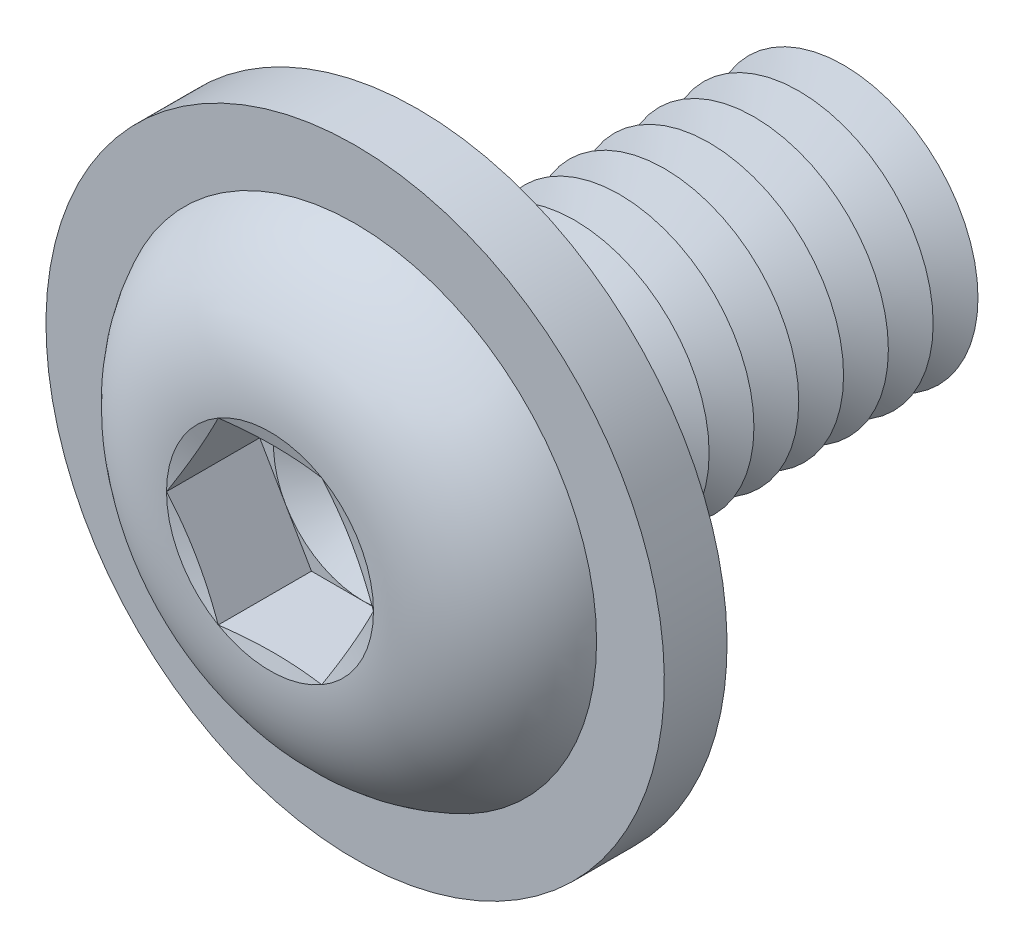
ISO-10303-21;
HEADER;
FILE_DESCRIPTION(('STEP AP214'),'2;1');
FILE_NAME('part.step','',(''),(''),'','','');
FILE_SCHEMA(('AUTOMOTIVE_DESIGN { 1 0 10303 214 1 1 1 1 }'));
ENDSEC;
DATA;
#1=APPLICATION_CONTEXT('core data for automotive mechanical design processes');
#2=APPLICATION_PROTOCOL_DEFINITION('international standard','automotive_design',2000,#1);
#3=PRODUCT_CONTEXT('',#1,'mechanical');
#4=PRODUCT('Part','Part','',(#3));
#5=PRODUCT_RELATED_PRODUCT_CATEGORY('part','',(#4));
#6=PRODUCT_DEFINITION_FORMATION('','',#4);
#7=PRODUCT_DEFINITION_CONTEXT('part definition',#1,'design');
#8=PRODUCT_DEFINITION('design','',#6,#7);
#9=PRODUCT_DEFINITION_SHAPE('','',#8);
#10=(LENGTH_UNIT() NAMED_UNIT(*) SI_UNIT(.MILLI.,.METRE.));
#11=(NAMED_UNIT(*) PLANE_ANGLE_UNIT() SI_UNIT($,.RADIAN.));
#12=(NAMED_UNIT(*) SI_UNIT($,.STERADIAN.) SOLID_ANGLE_UNIT());
#13=UNCERTAINTY_MEASURE_WITH_UNIT(LENGTH_MEASURE(1.E-05),#10,'distance_accuracy_value','');
#14=(GEOMETRIC_REPRESENTATION_CONTEXT(3) GLOBAL_UNCERTAINTY_ASSIGNED_CONTEXT((#13)) GLOBAL_UNIT_ASSIGNED_CONTEXT((#10,
#11,#12)) REPRESENTATION_CONTEXT('',''));
#15=CARTESIAN_POINT('',(0.,0.,0.));
#16=DIRECTION('',(0.,0.,1.));
#17=DIRECTION('',(1.,0.,0.));
#18=AXIS2_PLACEMENT_3D('',#15,#16,#17);
#19=CARTESIAN_POINT('',(0.,0.,-3.25));
#20=DIRECTION('',(0.,0.,1.));
#21=DIRECTION('',(1.,0.,0.));
#22=AXIS2_PLACEMENT_3D('',#19,#20,#21);
#23=CONICAL_SURFACE('',#22,1.5,1.0471975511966);
#24=CARTESIAN_POINT('',(0.,0.,-3.5));
#25=DIRECTION('',(0.,0.,1.));
#26=DIRECTION('',(1.,0.,0.));
#27=AXIS2_PLACEMENT_3D('',#24,#25,#26);
#28=CIRCLE('',#27,1.06698729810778);
#29=CARTESIAN_POINT('',(1.06698729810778,0.,-3.5));
#30=VERTEX_POINT('',#29);
#31=EDGE_CURVE('E290',#30,#30,#28,.T.);
#32=ORIENTED_EDGE('',*,*,#31,.T.);
#33=EDGE_LOOP('',(#32));
#34=FACE_BOUND('',#33,.T.);
#35=CARTESIAN_POINT('',(0.,0.,-3.25));
#36=DIRECTION('',(0.,0.,1.));
#37=DIRECTION('',(1.,0.,0.));
#38=AXIS2_PLACEMENT_3D('',#35,#36,#37);
#39=CIRCLE('',#38,1.5);
#40=CARTESIAN_POINT('',(1.5,0.,-3.25));
#41=VERTEX_POINT('',#40);
#42=EDGE_CURVE('E286',#41,#41,#39,.T.);
#43=ORIENTED_EDGE('',*,*,#42,.F.);
#44=EDGE_LOOP('',(#43));
#45=FACE_BOUND('',#44,.T.);
#46=ADVANCED_FACE('F39',(#34,#45),#23,.T.);
#47=CARTESIAN_POINT('',(0.,0.,-3.5));
#48=DIRECTION('',(0.,0.,-1.));
#49=DIRECTION('',(-1.,0.,0.));
#50=AXIS2_PLACEMENT_3D('',#47,#48,#49);
#51=CONICAL_SURFACE('',#50,1.06698729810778,1.0471975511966);
#52=CARTESIAN_POINT('',(0.,0.,-3.75));
#53=DIRECTION('',(0.,0.,1.));
#54=DIRECTION('',(1.,0.,0.));
#55=AXIS2_PLACEMENT_3D('',#52,#53,#54);
#56=CIRCLE('',#55,1.5);
#57=CARTESIAN_POINT('',(1.5,0.,-3.75));
#58=VERTEX_POINT('',#57);
#59=EDGE_CURVE('E294',#58,#58,#56,.T.);
#60=ORIENTED_EDGE('',*,*,#59,.T.);
#61=EDGE_LOOP('',(#60));
#62=FACE_BOUND('',#61,.T.);
#63=ORIENTED_EDGE('',*,*,#31,.F.);
#64=EDGE_LOOP('',(#63));
#65=FACE_BOUND('',#64,.T.);
#66=ADVANCED_FACE('F405',(#62,#65),#51,.T.);
#67=CARTESIAN_POINT('',(0.,1.5,-5.));
#68=DIRECTION('',(0.,0.,-1.));
#69=DIRECTION('',(-1.,0.,0.));
#70=AXIS2_PLACEMENT_3D('',#67,#68,#69);
#71=PLANE('',#70);
#72=CARTESIAN_POINT('',(0.,0.,-5.));
#73=DIRECTION('',(0.,0.,1.));
#74=DIRECTION('',(1.,0.,0.));
#75=AXIS2_PLACEMENT_3D('',#72,#73,#74);
#76=CIRCLE('',#75,1.06698729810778);
#77=CARTESIAN_POINT('',(1.06698729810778,0.,-5.));
#78=VERTEX_POINT('',#77);
#79=EDGE_CURVE('E314',#78,#78,#76,.T.);
#80=ORIENTED_EDGE('',*,*,#79,.F.);
#81=EDGE_LOOP('',(#80));
#82=FACE_BOUND('',#81,.T.);
#83=ADVANCED_FACE('F411',(#82),#71,.T.);
#84=CARTESIAN_POINT('',(0.,0.,-4.75));
#85=DIRECTION('',(0.,0.,1.));
#86=DIRECTION('',(1.,0.,0.));
#87=AXIS2_PLACEMENT_3D('',#84,#85,#86);
#88=CONICAL_SURFACE('',#87,1.5,1.0471975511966);
#89=ORIENTED_EDGE('',*,*,#79,.T.);
#90=EDGE_LOOP('',(#89));
#91=FACE_BOUND('',#90,.T.);
#92=CARTESIAN_POINT('',(0.,0.,-4.75));
#93=DIRECTION('',(0.,0.,1.));
#94=DIRECTION('',(1.,0.,0.));
#95=AXIS2_PLACEMENT_3D('',#92,#93,#94);
#96=CIRCLE('',#95,1.5);
#97=CARTESIAN_POINT('',(1.5,0.,-4.75));
#98=VERTEX_POINT('',#97);
#99=EDGE_CURVE('E310',#98,#98,#96,.T.);
#100=ORIENTED_EDGE('',*,*,#99,.F.);
#101=EDGE_LOOP('',(#100));
#102=FACE_BOUND('',#101,.T.);
#103=ADVANCED_FACE('F430',(#91,#102),#88,.T.);
#104=CARTESIAN_POINT('',(0.,0.,-4.5));
#105=DIRECTION('',(0.,0.,-1.));
#106=DIRECTION('',(-1.,0.,0.));
#107=AXIS2_PLACEMENT_3D('',#104,#105,#106);
#108=CONICAL_SURFACE('',#107,1.06698729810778,1.0471975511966);
#109=ORIENTED_EDGE('',*,*,#99,.T.);
#110=EDGE_LOOP('',(#109));
#111=FACE_BOUND('',#110,.T.);
#112=CARTESIAN_POINT('',(0.,0.,-4.5));
#113=DIRECTION('',(0.,0.,1.));
#114=DIRECTION('',(1.,0.,0.));
#115=AXIS2_PLACEMENT_3D('',#112,#113,#114);
#116=CIRCLE('',#115,1.06698729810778);
#117=CARTESIAN_POINT('',(1.06698729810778,0.,-4.5));
#118=VERTEX_POINT('',#117);
#119=EDGE_CURVE('E306',#118,#118,#116,.T.);
#120=ORIENTED_EDGE('',*,*,#119,.F.);
#121=EDGE_LOOP('',(#120));
#122=FACE_BOUND('',#121,.T.);
#123=ADVANCED_FACE('F427',(#111,#122),#108,.T.);
#124=CARTESIAN_POINT('',(0.,0.,-4.25));
#125=DIRECTION('',(0.,0.,1.));
#126=DIRECTION('',(1.,0.,0.));
#127=AXIS2_PLACEMENT_3D('',#124,#125,#126);
#128=CONICAL_SURFACE('',#127,1.5,1.0471975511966);
#129=ORIENTED_EDGE('',*,*,#119,.T.);
#130=EDGE_LOOP('',(#129));
#131=FACE_BOUND('',#130,.T.);
#132=CARTESIAN_POINT('',(0.,0.,-4.25));
#133=DIRECTION('',(0.,0.,1.));
#134=DIRECTION('',(1.,0.,0.));
#135=AXIS2_PLACEMENT_3D('',#132,#133,#134);
#136=CIRCLE('',#135,1.5);
#137=CARTESIAN_POINT('',(1.5,0.,-4.25));
#138=VERTEX_POINT('',#137);
#139=EDGE_CURVE('E302',#138,#138,#136,.T.);
#140=ORIENTED_EDGE('',*,*,#139,.F.);
#141=EDGE_LOOP('',(#140));
#142=FACE_BOUND('',#141,.T.);
#143=ADVANCED_FACE('F421',(#131,#142),#128,.T.);
#144=CARTESIAN_POINT('',(0.,0.,-4.));
#145=DIRECTION('',(0.,0.,-1.));
#146=DIRECTION('',(-1.,0.,0.));
#147=AXIS2_PLACEMENT_3D('',#144,#145,#146);
#148=CONICAL_SURFACE('',#147,1.06698729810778,1.0471975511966);
#149=ORIENTED_EDGE('',*,*,#139,.T.);
#150=EDGE_LOOP('',(#149));
#151=FACE_BOUND('',#150,.T.);
#152=CARTESIAN_POINT('',(0.,0.,-4.));
#153=DIRECTION('',(0.,0.,1.));
#154=DIRECTION('',(1.,0.,0.));
#155=AXIS2_PLACEMENT_3D('',#152,#153,#154);
#156=CIRCLE('',#155,1.06698729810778);
#157=CARTESIAN_POINT('',(1.06698729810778,0.,-4.));
#158=VERTEX_POINT('',#157);
#159=EDGE_CURVE('E298',#158,#158,#156,.T.);
#160=ORIENTED_EDGE('',*,*,#159,.F.);
#161=EDGE_LOOP('',(#160));
#162=FACE_BOUND('',#161,.T.);
#163=ADVANCED_FACE('F417',(#151,#162),#148,.T.);
#164=CARTESIAN_POINT('',(0.,0.,-3.75));
#165=DIRECTION('',(0.,0.,1.));
#166=DIRECTION('',(1.,0.,0.));
#167=AXIS2_PLACEMENT_3D('',#164,#165,#166);
#168=CONICAL_SURFACE('',#167,1.5,1.0471975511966);
#169=ORIENTED_EDGE('',*,*,#159,.T.);
#170=EDGE_LOOP('',(#169));
#171=FACE_BOUND('',#170,.T.);
#172=ORIENTED_EDGE('',*,*,#59,.F.);
#173=EDGE_LOOP('',(#172));
#174=FACE_BOUND('',#173,.T.);
#175=ADVANCED_FACE('F420',(#171,#174),#168,.T.);
#176=CARTESIAN_POINT('',(0.,0.,-2.75));
#177=DIRECTION('',(0.,0.,1.));
#178=DIRECTION('',(1.,0.,0.));
#179=AXIS2_PLACEMENT_3D('',#176,#177,#178);
#180=CONICAL_SURFACE('',#179,1.5,1.0471975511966);
#181=CARTESIAN_POINT('',(0.,0.,-3.));
#182=DIRECTION('',(0.,0.,1.));
#183=DIRECTION('',(1.,0.,0.));
#184=AXIS2_PLACEMENT_3D('',#181,#182,#183);
#185=CIRCLE('',#184,1.06698729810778);
#186=CARTESIAN_POINT('',(1.06698729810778,0.,-3.));
#187=VERTEX_POINT('',#186);
#188=EDGE_CURVE('E282',#187,#187,#185,.T.);
#189=ORIENTED_EDGE('',*,*,#188,.T.);
#190=EDGE_LOOP('',(#189));
#191=FACE_BOUND('',#190,.T.);
#192=CARTESIAN_POINT('',(0.,0.,-2.75));
#193=DIRECTION('',(0.,0.,1.));
#194=DIRECTION('',(1.,0.,0.));
#195=AXIS2_PLACEMENT_3D('',#192,#193,#194);
#196=CIRCLE('',#195,1.5);
#197=CARTESIAN_POINT('',(1.5,0.,-2.75));
#198=VERTEX_POINT('',#197);
#199=EDGE_CURVE('E278',#198,#198,#196,.T.);
#200=ORIENTED_EDGE('',*,*,#199,.F.);
#201=EDGE_LOOP('',(#200));
#202=FACE_BOUND('',#201,.T.);
#203=ADVANCED_FACE('F425',(#191,#202),#180,.T.);
#204=CARTESIAN_POINT('',(0.,0.,-3.));
#205=DIRECTION('',(0.,0.,-1.));
#206=DIRECTION('',(-1.,0.,0.));
#207=AXIS2_PLACEMENT_3D('',#204,#205,#206);
#208=CONICAL_SURFACE('',#207,1.06698729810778,1.0471975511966);
#209=ORIENTED_EDGE('',*,*,#42,.T.);
#210=EDGE_LOOP('',(#209));
#211=FACE_BOUND('',#210,.T.);
#212=ORIENTED_EDGE('',*,*,#188,.F.);
#213=EDGE_LOOP('',(#212));
#214=FACE_BOUND('',#213,.T.);
#215=ADVANCED_FACE('F476',(#211,#214),#208,.T.);
#216=CARTESIAN_POINT('',(0.,0.,-2.25));
#217=DIRECTION('',(0.,0.,1.));
#218=DIRECTION('',(1.,0.,0.));
#219=AXIS2_PLACEMENT_3D('',#216,#217,#218);
#220=CONICAL_SURFACE('',#219,1.5,1.0471975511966);
#221=CARTESIAN_POINT('',(0.,0.,-2.5));
#222=DIRECTION('',(0.,0.,1.));
#223=DIRECTION('',(1.,0.,0.));
#224=AXIS2_PLACEMENT_3D('',#221,#222,#223);
#225=CIRCLE('',#224,1.06698729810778);
#226=CARTESIAN_POINT('',(1.06698729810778,0.,-2.5));
#227=VERTEX_POINT('',#226);
#228=EDGE_CURVE('E274',#227,#227,#225,.T.);
#229=ORIENTED_EDGE('',*,*,#228,.T.);
#230=EDGE_LOOP('',(#229));
#231=FACE_BOUND('',#230,.T.);
#232=CARTESIAN_POINT('',(0.,0.,-2.25));
#233=DIRECTION('',(0.,0.,1.));
#234=DIRECTION('',(1.,0.,0.));
#235=AXIS2_PLACEMENT_3D('',#232,#233,#234);
#236=CIRCLE('',#235,1.5);
#237=CARTESIAN_POINT('',(1.5,0.,-2.25));
#238=VERTEX_POINT('',#237);
#239=EDGE_CURVE('E270',#238,#238,#236,.T.);
#240=ORIENTED_EDGE('',*,*,#239,.F.);
#241=EDGE_LOOP('',(#240));
#242=FACE_BOUND('',#241,.T.);
#243=ADVANCED_FACE('F482',(#231,#242),#220,.T.);
#244=CARTESIAN_POINT('',(0.,0.,-2.5));
#245=DIRECTION('',(0.,0.,-1.));
#246=DIRECTION('',(-1.,0.,0.));
#247=AXIS2_PLACEMENT_3D('',#244,#245,#246);
#248=CONICAL_SURFACE('',#247,1.06698729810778,1.0471975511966);
#249=ORIENTED_EDGE('',*,*,#199,.T.);
#250=EDGE_LOOP('',(#249));
#251=FACE_BOUND('',#250,.T.);
#252=ORIENTED_EDGE('',*,*,#228,.F.);
#253=EDGE_LOOP('',(#252));
#254=FACE_BOUND('',#253,.T.);
#255=ADVANCED_FACE('F489',(#251,#254),#248,.T.);
#256=CARTESIAN_POINT('',(0.,0.,-1.75));
#257=DIRECTION('',(0.,0.,1.));
#258=DIRECTION('',(1.,0.,0.));
#259=AXIS2_PLACEMENT_3D('',#256,#257,#258);
#260=CONICAL_SURFACE('',#259,1.5,1.0471975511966);
#261=CARTESIAN_POINT('',(0.,0.,-2.));
#262=DIRECTION('',(0.,0.,1.));
#263=DIRECTION('',(1.,0.,0.));
#264=AXIS2_PLACEMENT_3D('',#261,#262,#263);
#265=CIRCLE('',#264,1.06698729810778);
#266=CARTESIAN_POINT('',(1.06698729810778,0.,-2.));
#267=VERTEX_POINT('',#266);
#268=EDGE_CURVE('E266',#267,#267,#265,.T.);
#269=ORIENTED_EDGE('',*,*,#268,.T.);
#270=EDGE_LOOP('',(#269));
#271=FACE_BOUND('',#270,.T.);
#272=CARTESIAN_POINT('',(0.,0.,-1.75));
#273=DIRECTION('',(0.,0.,1.));
#274=DIRECTION('',(1.,0.,0.));
#275=AXIS2_PLACEMENT_3D('',#272,#273,#274);
#276=CIRCLE('',#275,1.5);
#277=CARTESIAN_POINT('',(1.5,0.,-1.75));
#278=VERTEX_POINT('',#277);
#279=EDGE_CURVE('E262',#278,#278,#276,.T.);
#280=ORIENTED_EDGE('',*,*,#279,.F.);
#281=EDGE_LOOP('',(#280));
#282=FACE_BOUND('',#281,.T.);
#283=ADVANCED_FACE('F496',(#271,#282),#260,.T.);
#284=CARTESIAN_POINT('',(0.,0.,-2.));
#285=DIRECTION('',(0.,0.,-1.));
#286=DIRECTION('',(-1.,0.,0.));
#287=AXIS2_PLACEMENT_3D('',#284,#285,#286);
#288=CONICAL_SURFACE('',#287,1.06698729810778,1.0471975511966);
#289=ORIENTED_EDGE('',*,*,#239,.T.);
#290=EDGE_LOOP('',(#289));
#291=FACE_BOUND('',#290,.T.);
#292=ORIENTED_EDGE('',*,*,#268,.F.);
#293=EDGE_LOOP('',(#292));
#294=FACE_BOUND('',#293,.T.);
#295=ADVANCED_FACE('F503',(#291,#294),#288,.T.);
#296=CARTESIAN_POINT('',(0.,0.,-1.25));
#297=DIRECTION('',(0.,0.,1.));
#298=DIRECTION('',(1.,0.,0.));
#299=AXIS2_PLACEMENT_3D('',#296,#297,#298);
#300=CONICAL_SURFACE('',#299,1.5,1.0471975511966);
#301=CARTESIAN_POINT('',(0.,0.,-1.5));
#302=DIRECTION('',(0.,0.,1.));
#303=DIRECTION('',(1.,0.,0.));
#304=AXIS2_PLACEMENT_3D('',#301,#302,#303);
#305=CIRCLE('',#304,1.06698729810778);
#306=CARTESIAN_POINT('',(1.06698729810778,0.,-1.5));
#307=VERTEX_POINT('',#306);
#308=EDGE_CURVE('E258',#307,#307,#305,.T.);
#309=ORIENTED_EDGE('',*,*,#308,.T.);
#310=EDGE_LOOP('',(#309));
#311=FACE_BOUND('',#310,.T.);
#312=CARTESIAN_POINT('',(0.,0.,-1.25));
#313=DIRECTION('',(0.,0.,1.));
#314=DIRECTION('',(1.,0.,0.));
#315=AXIS2_PLACEMENT_3D('',#312,#313,#314);
#316=CIRCLE('',#315,1.5);
#317=CARTESIAN_POINT('',(1.5,0.,-1.25));
#318=VERTEX_POINT('',#317);
#319=EDGE_CURVE('E254',#318,#318,#316,.T.);
#320=ORIENTED_EDGE('',*,*,#319,.F.);
#321=EDGE_LOOP('',(#320));
#322=FACE_BOUND('',#321,.T.);
#323=ADVANCED_FACE('F510',(#311,#322),#300,.T.);
#324=CARTESIAN_POINT('',(0.,0.,-1.5));
#325=DIRECTION('',(0.,0.,-1.));
#326=DIRECTION('',(-1.,0.,0.));
#327=AXIS2_PLACEMENT_3D('',#324,#325,#326);
#328=CONICAL_SURFACE('',#327,1.06698729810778,1.0471975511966);
#329=ORIENTED_EDGE('',*,*,#279,.T.);
#330=EDGE_LOOP('',(#329));
#331=FACE_BOUND('',#330,.T.);
#332=ORIENTED_EDGE('',*,*,#308,.F.);
#333=EDGE_LOOP('',(#332));
#334=FACE_BOUND('',#333,.T.);
#335=ADVANCED_FACE('F517',(#331,#334),#328,.T.);
#336=CARTESIAN_POINT('',(0.,0.,-0.75));
#337=DIRECTION('',(0.,0.,1.));
#338=DIRECTION('',(1.,0.,0.));
#339=AXIS2_PLACEMENT_3D('',#336,#337,#338);
#340=CONICAL_SURFACE('',#339,1.5,1.0471975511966);
#341=CARTESIAN_POINT('',(0.,0.,-1.));
#342=DIRECTION('',(0.,0.,1.));
#343=DIRECTION('',(1.,0.,0.));
#344=AXIS2_PLACEMENT_3D('',#341,#342,#343);
#345=CIRCLE('',#344,1.06698729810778);
#346=CARTESIAN_POINT('',(1.06698729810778,0.,-1.));
#347=VERTEX_POINT('',#346);
#348=EDGE_CURVE('E250',#347,#347,#345,.T.);
#349=ORIENTED_EDGE('',*,*,#348,.T.);
#350=EDGE_LOOP('',(#349));
#351=FACE_BOUND('',#350,.T.);
#352=CARTESIAN_POINT('',(0.,0.,-0.75));
#353=DIRECTION('',(0.,0.,1.));
#354=DIRECTION('',(1.,0.,0.));
#355=AXIS2_PLACEMENT_3D('',#352,#353,#354);
#356=CIRCLE('',#355,1.5);
#357=CARTESIAN_POINT('',(1.5,0.,-0.75));
#358=VERTEX_POINT('',#357);
#359=EDGE_CURVE('E242',#358,#358,#356,.T.);
#360=ORIENTED_EDGE('',*,*,#359,.F.);
#361=EDGE_LOOP('',(#360));
#362=FACE_BOUND('',#361,.T.);
#363=ADVANCED_FACE('F524',(#351,#362),#340,.T.);
#364=CARTESIAN_POINT('',(0.,0.,-1.));
#365=DIRECTION('',(0.,0.,-1.));
#366=DIRECTION('',(-1.,0.,0.));
#367=AXIS2_PLACEMENT_3D('',#364,#365,#366);
#368=CONICAL_SURFACE('',#367,1.06698729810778,1.0471975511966);
#369=ORIENTED_EDGE('',*,*,#319,.T.);
#370=EDGE_LOOP('',(#369));
#371=FACE_BOUND('',#370,.T.);
#372=ORIENTED_EDGE('',*,*,#348,.F.);
#373=EDGE_LOOP('',(#372));
#374=FACE_BOUND('',#373,.T.);
#375=ADVANCED_FACE('F531',(#371,#374),#368,.T.);
#376=CARTESIAN_POINT('',(0.,0.,-0.249999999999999));
#377=DIRECTION('',(0.,0.,1.));
#378=DIRECTION('',(1.,0.,0.));
#379=AXIS2_PLACEMENT_3D('',#376,#377,#378);
#380=CONICAL_SURFACE('',#379,1.5,1.0471975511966);
#381=CARTESIAN_POINT('',(0.,0.,-0.5));
#382=DIRECTION('',(0.,0.,1.));
#383=DIRECTION('',(1.,0.,0.));
#384=AXIS2_PLACEMENT_3D('',#381,#382,#383);
#385=CIRCLE('',#384,1.06698729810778);
#386=CARTESIAN_POINT('',(1.06698729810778,0.,-0.5));
#387=VERTEX_POINT('',#386);
#388=EDGE_CURVE('E231',#387,#387,#385,.T.);
#389=ORIENTED_EDGE('',*,*,#388,.T.);
#390=EDGE_LOOP('',(#389));
#391=FACE_BOUND('',#390,.T.);
#392=CARTESIAN_POINT('',(0.,0.,-0.249999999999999));
#393=DIRECTION('',(0.,0.,1.));
#394=DIRECTION('',(1.,0.,0.));
#395=AXIS2_PLACEMENT_3D('',#392,#393,#394);
#396=CIRCLE('',#395,1.5);
#397=CARTESIAN_POINT('',(1.5,0.,-0.249999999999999));
#398=VERTEX_POINT('',#397);
#399=EDGE_CURVE('E246',#398,#398,#396,.T.);
#400=ORIENTED_EDGE('',*,*,#399,.F.);
#401=EDGE_LOOP('',(#400));
#402=FACE_BOUND('',#401,.T.);
#403=ADVANCED_FACE('F538',(#391,#402),#380,.T.);
#404=CARTESIAN_POINT('',(0.,0.,-0.5));
#405=DIRECTION('',(0.,0.,-1.));
#406=DIRECTION('',(-1.,0.,0.));
#407=AXIS2_PLACEMENT_3D('',#404,#405,#406);
#408=CONICAL_SURFACE('',#407,1.06698729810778,1.0471975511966);
#409=ORIENTED_EDGE('',*,*,#359,.T.);
#410=EDGE_LOOP('',(#409));
#411=FACE_BOUND('',#410,.T.);
#412=ORIENTED_EDGE('',*,*,#388,.F.);
#413=EDGE_LOOP('',(#412));
#414=FACE_BOUND('',#413,.T.);
#415=ADVANCED_FACE('F220',(#411,#414),#408,.T.);
#416=CARTESIAN_POINT('',(0.,1.5,0.));
#417=DIRECTION('',(0.,0.,-1.));
#418=DIRECTION('',(-1.,0.,0.));
#419=AXIS2_PLACEMENT_3D('',#416,#417,#418);
#420=PLANE('',#419);
#421=CARTESIAN_POINT('',(0.,0.,0.));
#422=DIRECTION('',(0.,0.,-1.));
#423=DIRECTION('',(-1.,0.,0.));
#424=AXIS2_PLACEMENT_3D('',#421,#422,#423);
#425=CIRCLE('',#424,1.75);
#426=CARTESIAN_POINT('',(-1.75,0.,0.));
#427=VERTEX_POINT('',#426);
#428=EDGE_CURVE('E323',#427,#427,#425,.F.);
#429=ORIENTED_EDGE('',*,*,#428,.T.);
#430=EDGE_LOOP('',(#429));
#431=FACE_BOUND('',#430,.T.);
#432=CARTESIAN_POINT('',(0.,0.,0.));
#433=DIRECTION('',(0.,0.,-1.));
#434=DIRECTION('',(0.,1.,0.));
#435=AXIS2_PLACEMENT_3D('',#432,#433,#434);
#436=CIRCLE('',#435,3.45);
#437=CARTESIAN_POINT('',(0.,3.45,0.));
#438=VERTEX_POINT('',#437);
#439=EDGE_CURVE('E851',#438,#438,#436,.T.);
#440=ORIENTED_EDGE('',*,*,#439,.T.);
#441=EDGE_LOOP('',(#440));
#442=FACE_BOUND('',#441,.T.);
#443=ADVANCED_FACE('F550',(#431,#442),#420,.T.);
#444=CARTESIAN_POINT('',(0.,0.,-0.25));
#445=DIRECTION('',(0.,0.,-1.));
#446=DIRECTION('',(-1.,0.,0.));
#447=AXIS2_PLACEMENT_3D('',#444,#445,#446);
#448=TOROIDAL_SURFACE('',#447,1.75,0.25);
#449=ORIENTED_EDGE('',*,*,#428,.F.);
#450=EDGE_LOOP('',(#449));
#451=FACE_BOUND('',#450,.T.);
#452=ORIENTED_EDGE('',*,*,#399,.T.);
#453=EDGE_LOOP('',(#452));
#454=FACE_BOUND('',#453,.T.);
#455=ADVANCED_FACE('F41',(#451,#454),#448,.F.);
#456=CARTESIAN_POINT('',(0.,0.,0.7));
#457=DIRECTION('',(0.,0.,-1.));
#458=DIRECTION('',(0.,1.,0.));
#459=AXIS2_PLACEMENT_3D('',#456,#457,#458);
#460=CYLINDRICAL_SURFACE('',#459,3.45);
#461=CARTESIAN_POINT('',(0.,0.,0.7));
#462=DIRECTION('',(0.,0.,-1.));
#463=DIRECTION('',(0.,1.,0.));
#464=AXIS2_PLACEMENT_3D('',#461,#462,#463);
#465=CIRCLE('',#464,3.45);
#466=CARTESIAN_POINT('',(0.,3.45,0.7));
#467=VERTEX_POINT('',#466);
#468=EDGE_CURVE('E848',#467,#467,#465,.T.);
#469=ORIENTED_EDGE('',*,*,#468,.T.);
#470=EDGE_LOOP('',(#469));
#471=FACE_BOUND('',#470,.T.);
#472=ORIENTED_EDGE('',*,*,#439,.F.);
#473=EDGE_LOOP('',(#472));
#474=FACE_BOUND('',#473,.T.);
#475=ADVANCED_FACE('F561',(#471,#474),#460,.T.);
#476=CARTESIAN_POINT('',(0.,0.,0.7));
#477=DIRECTION('',(0.,0.,-1.));
#478=DIRECTION('',(0.,1.,0.));
#479=AXIS2_PLACEMENT_3D('',#476,#477,#478);
#480=PLANE('',#479);
#481=CARTESIAN_POINT('',(0.,0.,0.7));
#482=DIRECTION('',(0.,0.,-1.));
#483=DIRECTION('',(0.,1.,0.));
#484=AXIS2_PLACEMENT_3D('',#481,#482,#483);
#485=CIRCLE('',#484,2.69421838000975);
#486=CARTESIAN_POINT('',(0.,2.69421838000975,0.7));
#487=VERTEX_POINT('',#486);
#488=EDGE_CURVE('E43',#487,#487,#485,.F.);
#489=ORIENTED_EDGE('',*,*,#488,.F.);
#490=EDGE_LOOP('',(#489));
#491=FACE_BOUND('',#490,.T.);
#492=ORIENTED_EDGE('',*,*,#468,.F.);
#493=EDGE_LOOP('',(#492));
#494=FACE_BOUND('',#493,.T.);
#495=ADVANCED_FACE('F117',(#491,#494),#480,.F.);
#496=CARTESIAN_POINT('',(0.,0.,0.609999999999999));
#497=DIRECTION('',(0.,0.,1.));
#498=DIRECTION('',(1.,0.,0.));
#499=AXIS2_PLACEMENT_3D('',#496,#497,#498);
#500=CONICAL_SURFACE('',#499,0.99999953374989,1.0471975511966);
#501=CARTESIAN_POINT('',(0.,0.,0.0326500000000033));
#502=VERTEX_POINT('',#501);
#503=VERTEX_LOOP('',#502);
#504=FACE_BOUND('',#503,.T.);
#505=CARTESIAN_POINT('',(0.,0.,0.609999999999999));
#506=DIRECTION('',(0.,0.,1.));
#507=DIRECTION('',(1.,0.,0.));
#508=AXIS2_PLACEMENT_3D('',#505,#506,#507);
#509=CIRCLE('',#508,0.99999953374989);
#510=CARTESIAN_POINT('',(0.866024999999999,0.499999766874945,0.609999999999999));
#511=VERTEX_POINT('',#510);
#512=CARTESIAN_POINT('',(0.,0.99999953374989,0.609999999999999));
#513=VERTEX_POINT('',#512);
#514=EDGE_CURVE('E120',#511,#513,#509,.T.);
#515=ORIENTED_EDGE('',*,*,#514,.T.);
#516=CARTESIAN_POINT('',(0.,0.,0.609999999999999));
#517=DIRECTION('',(0.,0.,1.));
#518=DIRECTION('',(1.,0.,0.));
#519=AXIS2_PLACEMENT_3D('',#516,#517,#518);
#520=CIRCLE('',#519,0.99999953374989);
#521=CARTESIAN_POINT('',(-0.866024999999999,0.499999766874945,0.609999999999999));
#522=VERTEX_POINT('',#521);
#523=EDGE_CURVE('E11',#513,#522,#520,.T.);
#524=ORIENTED_EDGE('',*,*,#523,.T.);
#525=CARTESIAN_POINT('',(-0.866024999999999,-0.499999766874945,0.609999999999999));
#526=VERTEX_POINT('',#525);
#527=EDGE_CURVE('E49',#522,#526,#520,.T.);
#528=ORIENTED_EDGE('',*,*,#527,.T.);
#529=CARTESIAN_POINT('',(0.,-0.99999953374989,0.609999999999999));
#530=VERTEX_POINT('',#529);
#531=EDGE_CURVE('E330',#526,#530,#520,.T.);
#532=ORIENTED_EDGE('',*,*,#531,.T.);
#533=CARTESIAN_POINT('',(0.866024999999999,-0.499999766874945,0.609999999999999));
#534=VERTEX_POINT('',#533);
#535=EDGE_CURVE('E57',#530,#534,#520,.T.);
#536=ORIENTED_EDGE('',*,*,#535,.T.);
#537=EDGE_CURVE('E50',#534,#511,#520,.T.);
#538=ORIENTED_EDGE('',*,*,#537,.T.);
#539=EDGE_LOOP('',(#515,#524,#528,#532,#536,#538));
#540=FACE_BOUND('',#539,.T.);
#541=ADVANCED_FACE('F114',(#504,#540),#500,.F.);
#542=CARTESIAN_POINT('',(0.,0.,0.609999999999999));
#543=DIRECTION('',(0.,0.,1.));
#544=DIRECTION('',(1.,0.,0.));
#545=AXIS2_PLACEMENT_3D('',#542,#543,#544);
#546=PLANE('',#545);
#547=ORIENTED_EDGE('',*,*,#531,.F.);
#548=DIRECTION('',(0.5,-0.866025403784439,0.));
#549=VECTOR('',#548,1.);
#550=CARTESIAN_POINT('',(-1.1547,0.,0.609999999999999));
#551=LINE('',#550,#549);
#552=CARTESIAN_POINT('',(-0.577349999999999,-0.99999953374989,0.609999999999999));
#553=VERTEX_POINT('',#552);
#554=EDGE_CURVE('E154',#526,#553,#551,.T.);
#555=ORIENTED_EDGE('',*,*,#554,.T.);
#556=DIRECTION('',(1.,0.,0.));
#557=VECTOR('',#556,1.);
#558=CARTESIAN_POINT('',(-0.577349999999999,-0.99999953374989,0.609999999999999));
#559=LINE('',#558,#557);
#560=EDGE_CURVE('E160',#553,#530,#559,.T.);
#561=ORIENTED_EDGE('',*,*,#560,.T.);
#562=EDGE_LOOP('',(#547,#555,#561));
#563=FACE_BOUND('',#562,.T.);
#564=ADVANCED_FACE('F116',(#563),#546,.T.);
#565=ORIENTED_EDGE('',*,*,#535,.F.);
#566=CARTESIAN_POINT('',(0.577349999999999,-0.99999953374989,0.609999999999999));
#567=VERTEX_POINT('',#566);
#568=EDGE_CURVE('E159',#530,#567,#559,.T.);
#569=ORIENTED_EDGE('',*,*,#568,.T.);
#570=DIRECTION('',(0.5,0.866025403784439,0.));
#571=VECTOR('',#570,1.);
#572=CARTESIAN_POINT('',(0.577349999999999,-0.99999953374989,0.609999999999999));
#573=LINE('',#572,#571);
#574=EDGE_CURVE('E165',#567,#534,#573,.T.);
#575=ORIENTED_EDGE('',*,*,#574,.T.);
#576=EDGE_LOOP('',(#565,#569,#575));
#577=FACE_BOUND('',#576,.T.);
#578=ADVANCED_FACE('F582',(#577),#546,.T.);
#579=ORIENTED_EDGE('',*,*,#537,.F.);
#580=CARTESIAN_POINT('',(1.1547,0.,0.609999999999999));
#581=VERTEX_POINT('',#580);
#582=EDGE_CURVE('E164',#534,#581,#573,.T.);
#583=ORIENTED_EDGE('',*,*,#582,.T.);
#584=DIRECTION('',(-0.5,0.866025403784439,0.));
#585=VECTOR('',#584,1.);
#586=CARTESIAN_POINT('',(1.1547,0.,0.609999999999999));
#587=LINE('',#586,#585);
#588=EDGE_CURVE('E142',#581,#511,#587,.T.);
#589=ORIENTED_EDGE('',*,*,#588,.T.);
#590=EDGE_LOOP('',(#579,#583,#589));
#591=FACE_BOUND('',#590,.T.);
#592=ADVANCED_FACE('F587',(#591),#546,.T.);
#593=ORIENTED_EDGE('',*,*,#514,.F.);
#594=CARTESIAN_POINT('',(0.577349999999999,0.99999953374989,0.609999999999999));
#595=VERTEX_POINT('',#594);
#596=EDGE_CURVE('E127',#511,#595,#587,.T.);
#597=ORIENTED_EDGE('',*,*,#596,.T.);
#598=DIRECTION('',(-1.,0.,0.));
#599=VECTOR('',#598,1.);
#600=CARTESIAN_POINT('',(0.577349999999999,0.99999953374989,0.609999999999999));
#601=LINE('',#600,#599);
#602=EDGE_CURVE('E138',#595,#513,#601,.T.);
#603=ORIENTED_EDGE('',*,*,#602,.T.);
#604=EDGE_LOOP('',(#593,#597,#603));
#605=FACE_BOUND('',#604,.T.);
#606=ADVANCED_FACE('F144',(#605),#546,.T.);
#607=ORIENTED_EDGE('',*,*,#523,.F.);
#608=CARTESIAN_POINT('',(-0.577350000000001,0.999999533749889,0.609999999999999));
#609=VERTEX_POINT('',#608);
#610=EDGE_CURVE('E133',#513,#609,#601,.T.);
#611=ORIENTED_EDGE('',*,*,#610,.T.);
#612=DIRECTION('',(-0.5,-0.866025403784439,0.));
#613=VECTOR('',#612,1.);
#614=CARTESIAN_POINT('',(-0.577350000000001,0.999999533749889,0.609999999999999));
#615=LINE('',#614,#613);
#616=EDGE_CURVE('E136',#609,#522,#615,.T.);
#617=ORIENTED_EDGE('',*,*,#616,.T.);
#618=EDGE_LOOP('',(#607,#611,#617));
#619=FACE_BOUND('',#618,.T.);
#620=ADVANCED_FACE('F132',(#619),#546,.T.);
#621=ORIENTED_EDGE('',*,*,#527,.F.);
#622=CARTESIAN_POINT('',(-1.1547,0.,0.609999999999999));
#623=VERTEX_POINT('',#622);
#624=EDGE_CURVE('E146',#522,#623,#615,.T.);
#625=ORIENTED_EDGE('',*,*,#624,.T.);
#626=EDGE_CURVE('E155',#623,#526,#551,.T.);
#627=ORIENTED_EDGE('',*,*,#626,.T.);
#628=EDGE_LOOP('',(#621,#625,#627));
#629=FACE_BOUND('',#628,.T.);
#630=ADVANCED_FACE('F343',(#629),#546,.T.);
#631=CARTESIAN_POINT('',(-1.1547,0.,0.609999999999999));
#632=DIRECTION('',(-0.866025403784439,-0.5,0.));
#633=DIRECTION('',(0.5,-0.866025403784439,0.));
#634=AXIS2_PLACEMENT_3D('',#631,#632,#633);
#635=PLANE('',#634);
#636=CARTESIAN_POINT('',(-1.15481547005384,0.000200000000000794,1.65003094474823));
#637=CARTESIAN_POINT('',(-1.13083002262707,-0.0413440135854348,1.64359970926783));
#638=CARTESIAN_POINT('',(-1.10680107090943,-0.0829633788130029,1.63776108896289));
#639=CARTESIAN_POINT('',(-1.05865826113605,-0.166349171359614,1.62750303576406));
#640=CARTESIAN_POINT('',(-1.03454437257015,-0.208115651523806,1.62308418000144));
#641=CARTESIAN_POINT('',(-0.986377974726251,-0.291542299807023,1.61592375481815));
#642=CARTESIAN_POINT('',(-0.962325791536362,-0.333201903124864,1.61317364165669));
#643=CARTESIAN_POINT('',(-0.914190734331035,-0.416574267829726,1.60948600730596));
#644=CARTESIAN_POINT('',(-0.890107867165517,-0.458287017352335,1.60854813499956));
#645=CARTESIAN_POINT('',(-0.841942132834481,-0.541712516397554,1.60854813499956));
#646=CARTESIAN_POINT('',(-0.817859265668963,-0.583425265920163,1.60948600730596));
#647=CARTESIAN_POINT('',(-0.769724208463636,-0.666797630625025,1.61317364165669));
#648=CARTESIAN_POINT('',(-0.745672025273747,-0.708457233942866,1.61592375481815));
#649=CARTESIAN_POINT('',(-0.697505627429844,-0.791883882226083,1.62308418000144));
#650=CARTESIAN_POINT('',(-0.673391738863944,-0.833650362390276,1.62750303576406));
#651=CARTESIAN_POINT('',(-0.625248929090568,-0.917036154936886,1.63776108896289));
#652=CARTESIAN_POINT('',(-0.60121997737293,-0.958655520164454,1.64359970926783));
#653=CARTESIAN_POINT('',(-0.577234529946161,-1.00019953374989,1.65003094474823));
#654=B_SPLINE_CURVE_WITH_KNOTS('',3,(#636,#637,#638,#639,#640,#641,#642,#643,#644,#645,#646,
#647,#648,#649,#650,#651,#652,#653),.UNSPECIFIED.,.F.,.F.,(4,2,2,2,2,2,2,2,4),(0.,
0.145207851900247,0.290474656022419,0.434991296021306,0.579479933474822,0.723968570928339,
0.868485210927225,1.0137520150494,1.15895986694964),.UNSPECIFIED.);
#655=CARTESIAN_POINT('',(-1.1547,0.,1.65));
#656=VERTEX_POINT('',#655);
#657=CARTESIAN_POINT('',(-0.577349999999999,-0.99999953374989,1.65));
#658=VERTEX_POINT('',#657);
#659=EDGE_CURVE('E348',#656,#658,#654,.T.);
#660=ORIENTED_EDGE('',*,*,#659,.T.);
#661=DIRECTION('',(0.,0.,1.));
#662=VECTOR('',#661,1.);
#663=CARTESIAN_POINT('',(-0.577349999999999,-0.99999953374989,0.609999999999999));
#664=LINE('',#663,#662);
#665=EDGE_CURVE('E178',#553,#658,#664,.T.);
#666=ORIENTED_EDGE('',*,*,#665,.F.);
#667=ORIENTED_EDGE('',*,*,#554,.F.);
#668=ORIENTED_EDGE('',*,*,#626,.F.);
#669=DIRECTION('',(0.,0.,1.));
#670=VECTOR('',#669,1.);
#671=CARTESIAN_POINT('',(-1.1547,0.,0.609999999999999));
#672=LINE('',#671,#670);
#673=EDGE_CURVE('E182',#623,#656,#672,.T.);
#674=ORIENTED_EDGE('',*,*,#673,.T.);
#675=EDGE_LOOP('',(#660,#666,#667,#668,#674));
#676=FACE_BOUND('',#675,.T.);
#677=ADVANCED_FACE('F342',(#676),#635,.F.);
#678=CARTESIAN_POINT('',(-0.577349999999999,-0.99999953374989,0.609999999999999));
#679=DIRECTION('',(0.,-1.,0.));
#680=DIRECTION('',(0.,0.,-1.));
#681=AXIS2_PLACEMENT_3D('',#678,#679,#680);
#682=PLANE('',#681);
#683=CARTESIAN_POINT('',(-1.7425668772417,-0.99999953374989,1.87893949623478));
#684=CARTESIAN_POINT('',(-1.65819693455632,-0.99999953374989,1.85935934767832));
#685=CARTESIAN_POINT('',(-1.57375647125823,-0.99999953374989,1.84006351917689));
#686=CARTESIAN_POINT('',(-1.40464514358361,-0.99999953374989,1.80242908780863));
#687=CARTESIAN_POINT('',(-1.31997423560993,-0.99999953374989,1.78409068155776));
#688=CARTESIAN_POINT('',(-1.14955192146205,-0.99999953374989,1.74860242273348));
#689=CARTESIAN_POINT('',(-1.06379782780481,-0.99999953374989,1.73146532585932));
#690=CARTESIAN_POINT('',(-0.891887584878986,-0.99999953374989,1.69925819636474));
#691=CARTESIAN_POINT('',(-0.805731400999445,-0.99999953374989,1.68418834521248));
#692=CARTESIAN_POINT('',(-0.635256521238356,-0.99999953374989,1.65751615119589));
#693=CARTESIAN_POINT('',(-0.550951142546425,-0.99999953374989,1.64583105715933));
#694=CARTESIAN_POINT('',(-0.381865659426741,-0.99999953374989,1.62668811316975));
#695=CARTESIAN_POINT('',(-0.297085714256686,-0.99999953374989,1.61922892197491));
#696=CARTESIAN_POINT('',(-0.127577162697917,-0.99999953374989,1.60981453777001));
#697=CARTESIAN_POINT('',(-0.0428499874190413,-0.99999953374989,1.60783514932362));
#698=CARTESIAN_POINT('',(0.126542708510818,-0.99999953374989,1.60973012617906));
#699=CARTESIAN_POINT('',(0.211208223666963,-0.99999953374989,1.61360496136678));
#700=CARTESIAN_POINT('',(0.356115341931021,-0.99999953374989,1.62460226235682));
#701=CARTESIAN_POINT('',(0.416458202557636,-0.99999953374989,1.63048841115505));
#702=CARTESIAN_POINT('',(0.536893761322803,-0.99999953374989,1.64437752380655));
#703=CARTESIAN_POINT('',(0.596986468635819,-0.99999953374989,1.65238040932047));
#704=CARTESIAN_POINT('',(0.777275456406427,-0.99999953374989,1.67888855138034));
#705=CARTESIAN_POINT('',(0.897104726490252,-0.99999953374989,1.69985858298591));
#706=CARTESIAN_POINT('',(1.07751611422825,-0.99999953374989,1.73433574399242));
#707=CARTESIAN_POINT('',(1.1383777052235,-0.99999953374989,1.74646914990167));
#708=CARTESIAN_POINT('',(1.25994955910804,-0.99999953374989,1.7714845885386));
#709=CARTESIAN_POINT('',(1.32065982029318,-0.99999953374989,1.7843666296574));
#710=CARTESIAN_POINT('',(1.44162663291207,-0.99999953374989,1.81062164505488));
#711=CARTESIAN_POINT('',(1.50188385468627,-0.99999953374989,1.82399156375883));
#712=CARTESIAN_POINT('',(1.62229550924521,-0.99999953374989,1.85116781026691));
#713=CARTESIAN_POINT('',(1.68244994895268,-0.99999953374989,1.86497410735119));
#714=CARTESIAN_POINT('',(1.7425668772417,-0.99999953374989,1.87893949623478));
#715=B_SPLINE_CURVE_WITH_KNOTS('',3,(#683,#684,#685,#686,#687,#688,#689,#690,#691,#692,#693,
#694,#695,#696,#697,#698,#699,#700,#701,#702,#703,#704,#705,#706,#707,#708,#709,#710,#711,#712,
#713,#714),.UNSPECIFIED.,.F.,.F.,(4,2,2,2,2,2,2,2,2,2,2,2,2,2,2,4),(0.,0.259842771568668,
0.519738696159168,0.782071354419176,1.04442702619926,1.29968778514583,1.55486748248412,
1.80891865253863,2.06299021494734,2.24483732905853,2.42667771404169,2.79149503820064,
2.97767344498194,3.16385393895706,3.34902052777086,3.53417411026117),.UNSPECIFIED.);
#716=CARTESIAN_POINT('',(0.577349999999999,-0.99999953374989,1.65));
#717=VERTEX_POINT('',#716);
#718=EDGE_CURVE('E355',#658,#717,#715,.T.);
#719=ORIENTED_EDGE('',*,*,#718,.T.);
#720=DIRECTION('',(0.,0.,1.));
#721=VECTOR('',#720,1.);
#722=CARTESIAN_POINT('',(0.577349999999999,-0.99999953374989,0.609999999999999));
#723=LINE('',#722,#721);
#724=EDGE_CURVE('E174',#567,#717,#723,.T.);
#725=ORIENTED_EDGE('',*,*,#724,.F.);
#726=ORIENTED_EDGE('',*,*,#568,.F.);
#727=ORIENTED_EDGE('',*,*,#560,.F.);
#728=ORIENTED_EDGE('',*,*,#665,.T.);
#729=EDGE_LOOP('',(#719,#725,#726,#727,#728));
#730=FACE_BOUND('',#729,.T.);
#731=ADVANCED_FACE('F394',(#730),#682,.F.);
#732=CARTESIAN_POINT('',(0.577349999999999,-0.99999953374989,0.609999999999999));
#733=DIRECTION('',(0.866025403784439,-0.5,0.));
#734=DIRECTION('',(0.5,0.866025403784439,0.));
#735=AXIS2_PLACEMENT_3D('',#732,#733,#734);
#736=PLANE('',#735);
#737=CARTESIAN_POINT('',(0.577234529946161,-1.00019953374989,1.65003094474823));
#738=CARTESIAN_POINT('',(0.601219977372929,-0.958655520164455,1.64359970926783));
#739=CARTESIAN_POINT('',(0.625248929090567,-0.917036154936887,1.63776108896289));
#740=CARTESIAN_POINT('',(0.673391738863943,-0.833650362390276,1.62750303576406));
#741=CARTESIAN_POINT('',(0.697505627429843,-0.791883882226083,1.62308418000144));
#742=CARTESIAN_POINT('',(0.745672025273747,-0.708457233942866,1.61592375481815));
#743=CARTESIAN_POINT('',(0.769724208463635,-0.666797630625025,1.61317364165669));
#744=CARTESIAN_POINT('',(0.817859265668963,-0.583425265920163,1.60948600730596));
#745=CARTESIAN_POINT('',(0.841942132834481,-0.541712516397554,1.60854813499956));
#746=CARTESIAN_POINT('',(0.890107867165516,-0.458287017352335,1.60854813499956));
#747=CARTESIAN_POINT('',(0.914190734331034,-0.416574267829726,1.60948600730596));
#748=CARTESIAN_POINT('',(0.962325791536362,-0.333201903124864,1.61317364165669));
#749=CARTESIAN_POINT('',(0.986377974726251,-0.291542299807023,1.61592375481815));
#750=CARTESIAN_POINT('',(1.03454437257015,-0.208115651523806,1.62308418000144));
#751=CARTESIAN_POINT('',(1.05865826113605,-0.166349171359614,1.62750303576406));
#752=CARTESIAN_POINT('',(1.10680107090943,-0.0829633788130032,1.63776108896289));
#753=CARTESIAN_POINT('',(1.13083002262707,-0.0413440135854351,1.64359970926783));
#754=CARTESIAN_POINT('',(1.15481547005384,0.0002000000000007,1.65003094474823));
#755=B_SPLINE_CURVE_WITH_KNOTS('',3,(#737,#738,#739,#740,#741,#742,#743,#744,#745,#746,#747,
#748,#749,#750,#751,#752,#753,#754),.UNSPECIFIED.,.F.,.F.,(4,2,2,2,2,2,2,2,4),(0.,
0.145207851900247,0.290474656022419,0.434991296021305,0.579479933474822,0.723968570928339,
0.868485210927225,1.0137520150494,1.15895986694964),.UNSPECIFIED.);
#756=CARTESIAN_POINT('',(1.1547,0.,1.65));
#757=VERTEX_POINT('',#756);
#758=EDGE_CURVE('E232',#717,#757,#755,.T.);
#759=ORIENTED_EDGE('',*,*,#758,.T.);
#760=DIRECTION('',(0.,0.,1.));
#761=VECTOR('',#760,1.);
#762=CARTESIAN_POINT('',(1.1547,0.,0.609999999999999));
#763=LINE('',#762,#761);
#764=EDGE_CURVE('E169',#581,#757,#763,.T.);
#765=ORIENTED_EDGE('',*,*,#764,.F.);
#766=ORIENTED_EDGE('',*,*,#582,.F.);
#767=ORIENTED_EDGE('',*,*,#574,.F.);
#768=ORIENTED_EDGE('',*,*,#724,.T.);
#769=EDGE_LOOP('',(#759,#765,#766,#767,#768));
#770=FACE_BOUND('',#769,.T.);
#771=ADVANCED_FACE('F218',(#770),#736,.F.);
#772=CARTESIAN_POINT('',(1.1547,0.,0.609999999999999));
#773=DIRECTION('',(0.866025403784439,0.5,0.));
#774=DIRECTION('',(-0.5,0.866025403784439,0.));
#775=AXIS2_PLACEMENT_3D('',#772,#773,#774);
#776=PLANE('',#775);
#777=CARTESIAN_POINT('',(1.15481547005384,-0.000199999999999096,1.65003094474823));
#778=CARTESIAN_POINT('',(1.13083002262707,0.0413440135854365,1.64359970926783));
#779=CARTESIAN_POINT('',(1.10680107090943,0.0829633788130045,1.63776108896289));
#780=CARTESIAN_POINT('',(1.05865826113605,0.166349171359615,1.62750303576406));
#781=CARTESIAN_POINT('',(1.03454437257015,0.208115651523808,1.62308418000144));
#782=CARTESIAN_POINT('',(0.986377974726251,0.291542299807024,1.61592375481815));
#783=CARTESIAN_POINT('',(0.962325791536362,0.333201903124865,1.61317364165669));
#784=CARTESIAN_POINT('',(0.914190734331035,0.416574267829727,1.60948600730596));
#785=CARTESIAN_POINT('',(0.890107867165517,0.458287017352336,1.60854813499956));
#786=CARTESIAN_POINT('',(0.841942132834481,0.541712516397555,1.60854813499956));
#787=CARTESIAN_POINT('',(0.817859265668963,0.583425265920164,1.60948600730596));
#788=CARTESIAN_POINT('',(0.769724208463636,0.666797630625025,1.61317364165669));
#789=CARTESIAN_POINT('',(0.745672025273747,0.708457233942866,1.61592375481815));
#790=CARTESIAN_POINT('',(0.697505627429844,0.791883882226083,1.62308418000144));
#791=CARTESIAN_POINT('',(0.673391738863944,0.833650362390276,1.62750303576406));
#792=CARTESIAN_POINT('',(0.625248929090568,0.917036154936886,1.63776108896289));
#793=CARTESIAN_POINT('',(0.60121997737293,0.958655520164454,1.64359970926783));
#794=CARTESIAN_POINT('',(0.577234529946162,1.00019953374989,1.65003094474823));
#795=B_SPLINE_CURVE_WITH_KNOTS('',3,(#777,#778,#779,#780,#781,#782,#783,#784,#785,#786,#787,
#788,#789,#790,#791,#792,#793,#794),.UNSPECIFIED.,.F.,.F.,(4,2,2,2,2,2,2,2,4),(0.,
0.145207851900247,0.290474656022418,0.434991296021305,0.579479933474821,0.723968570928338,
0.868485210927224,1.0137520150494,1.15895986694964),.UNSPECIFIED.);
#796=CARTESIAN_POINT('',(0.577349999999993,0.999999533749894,1.65));
#797=VERTEX_POINT('',#796);
#798=EDGE_CURVE('E223',#757,#797,#795,.T.);
#799=ORIENTED_EDGE('',*,*,#798,.T.);
#800=DIRECTION('',(0.,0.,1.));
#801=VECTOR('',#800,1.);
#802=CARTESIAN_POINT('',(0.577349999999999,0.99999953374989,0.609999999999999));
#803=LINE('',#802,#801);
#804=EDGE_CURVE('E65',#595,#797,#803,.T.);
#805=ORIENTED_EDGE('',*,*,#804,.F.);
#806=ORIENTED_EDGE('',*,*,#596,.F.);
#807=ORIENTED_EDGE('',*,*,#588,.F.);
#808=ORIENTED_EDGE('',*,*,#764,.T.);
#809=EDGE_LOOP('',(#799,#805,#806,#807,#808));
#810=FACE_BOUND('',#809,.T.);
#811=ADVANCED_FACE('F212',(#810),#776,.F.);
#812=CARTESIAN_POINT('',(0.577349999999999,0.99999953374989,0.609999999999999));
#813=DIRECTION('',(0.,1.,0.));
#814=DIRECTION('',(-1.,0.,0.));
#815=AXIS2_PLACEMENT_3D('',#812,#813,#814);
#816=PLANE('',#815);
#817=CARTESIAN_POINT('',(1.7425668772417,0.99999953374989,1.87893949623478));
#818=CARTESIAN_POINT('',(1.65819693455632,0.999999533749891,1.85935934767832));
#819=CARTESIAN_POINT('',(1.57375647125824,0.99999953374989,1.84006351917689));
#820=CARTESIAN_POINT('',(1.40464514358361,0.99999953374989,1.80242908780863));
#821=CARTESIAN_POINT('',(1.31997423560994,0.99999953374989,1.78409068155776));
#822=CARTESIAN_POINT('',(1.14955192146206,0.99999953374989,1.74860242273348));
#823=CARTESIAN_POINT('',(1.06379782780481,0.99999953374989,1.73146532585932));
#824=CARTESIAN_POINT('',(0.891887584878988,0.99999953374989,1.69925819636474));
#825=CARTESIAN_POINT('',(0.805731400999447,0.99999953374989,1.68418834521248));
#826=CARTESIAN_POINT('',(0.635256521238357,0.99999953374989,1.65751615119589));
#827=CARTESIAN_POINT('',(0.550951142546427,0.99999953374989,1.64583105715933));
#828=CARTESIAN_POINT('',(0.381865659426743,0.99999953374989,1.62668811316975));
#829=CARTESIAN_POINT('',(0.297085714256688,0.99999953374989,1.61922892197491));
#830=CARTESIAN_POINT('',(0.127577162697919,0.99999953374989,1.60981453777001));
#831=CARTESIAN_POINT('',(0.0428499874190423,0.99999953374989,1.60783514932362));
#832=CARTESIAN_POINT('',(-0.126542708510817,0.99999953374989,1.60973012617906));
#833=CARTESIAN_POINT('',(-0.211208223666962,0.999999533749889,1.61360496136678));
#834=CARTESIAN_POINT('',(-0.356115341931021,0.999999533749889,1.62460226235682));
#835=CARTESIAN_POINT('',(-0.416458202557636,0.999999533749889,1.63048841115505));
#836=CARTESIAN_POINT('',(-0.536893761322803,0.999999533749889,1.64437752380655));
#837=CARTESIAN_POINT('',(-0.596986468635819,0.999999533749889,1.65238040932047));
#838=CARTESIAN_POINT('',(-0.777275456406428,0.999999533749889,1.67888855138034));
#839=CARTESIAN_POINT('',(-0.897104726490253,0.999999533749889,1.69985858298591));
#840=CARTESIAN_POINT('',(-1.07751611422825,0.999999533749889,1.73433574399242));
#841=CARTESIAN_POINT('',(-1.1383777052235,0.999999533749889,1.74646914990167));
#842=CARTESIAN_POINT('',(-1.25994955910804,0.999999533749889,1.7714845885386));
#843=CARTESIAN_POINT('',(-1.32065982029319,0.999999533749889,1.7843666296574));
#844=CARTESIAN_POINT('',(-1.44162663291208,0.999999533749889,1.81062164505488));
#845=CARTESIAN_POINT('',(-1.50188385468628,0.999999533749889,1.82399156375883));
#846=CARTESIAN_POINT('',(-1.62229550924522,0.999999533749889,1.85116781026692));
#847=CARTESIAN_POINT('',(-1.68244994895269,0.999999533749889,1.86497410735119));
#848=CARTESIAN_POINT('',(-1.7425668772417,0.999999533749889,1.87893949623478));
#849=B_SPLINE_CURVE_WITH_KNOTS('',3,(#817,#818,#819,#820,#821,#822,#823,#824,#825,#826,#827,
#828,#829,#830,#831,#832,#833,#834,#835,#836,#837,#838,#839,#840,#841,#842,#843,#844,#845,#846,
#847,#848),.UNSPECIFIED.,.F.,.F.,(4,2,2,2,2,2,2,2,2,2,2,2,2,2,2,4),(0.,0.259842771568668,
0.519738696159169,0.782071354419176,1.04442702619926,1.29968778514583,1.55486748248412,
1.80891865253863,2.06299021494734,2.24483732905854,2.42667771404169,2.79149503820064,
2.97767344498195,3.16385393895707,3.34902052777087,3.53417411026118),.UNSPECIFIED.);
#850=CARTESIAN_POINT('',(-0.577350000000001,0.999999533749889,1.65));
#851=VERTEX_POINT('',#850);
#852=EDGE_CURVE('E173',#797,#851,#849,.T.);
#853=ORIENTED_EDGE('',*,*,#852,.T.);
#854=DIRECTION('',(0.,0.,1.));
#855=VECTOR('',#854,1.);
#856=CARTESIAN_POINT('',(-0.577350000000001,0.999999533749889,0.609999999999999));
#857=LINE('',#856,#855);
#858=EDGE_CURVE('E140',#609,#851,#857,.T.);
#859=ORIENTED_EDGE('',*,*,#858,.F.);
#860=ORIENTED_EDGE('',*,*,#610,.F.);
#861=ORIENTED_EDGE('',*,*,#602,.F.);
#862=ORIENTED_EDGE('',*,*,#804,.T.);
#863=EDGE_LOOP('',(#853,#859,#860,#861,#862));
#864=FACE_BOUND('',#863,.T.);
#865=ADVANCED_FACE('F137',(#864),#816,.F.);
#866=CARTESIAN_POINT('',(-0.577350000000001,0.999999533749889,0.609999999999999));
#867=DIRECTION('',(-0.866025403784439,0.5,0.));
#868=DIRECTION('',(-0.5,-0.866025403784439,0.));
#869=AXIS2_PLACEMENT_3D('',#866,#867,#868);
#870=PLANE('',#869);
#871=CARTESIAN_POINT('',(-0.577234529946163,1.00019953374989,1.65003094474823));
#872=CARTESIAN_POINT('',(-0.601219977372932,0.958655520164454,1.64359970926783));
#873=CARTESIAN_POINT('',(-0.625248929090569,0.917036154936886,1.63776108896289));
#874=CARTESIAN_POINT('',(-0.673391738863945,0.833650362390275,1.62750303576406));
#875=CARTESIAN_POINT('',(-0.697505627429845,0.791883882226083,1.62308418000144));
#876=CARTESIAN_POINT('',(-0.745672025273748,0.708457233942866,1.61592375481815));
#877=CARTESIAN_POINT('',(-0.769724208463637,0.666797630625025,1.61317364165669));
#878=CARTESIAN_POINT('',(-0.817859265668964,0.583425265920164,1.60948600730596));
#879=CARTESIAN_POINT('',(-0.841942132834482,0.541712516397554,1.60854813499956));
#880=CARTESIAN_POINT('',(-0.890107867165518,0.458287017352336,1.60854813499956));
#881=CARTESIAN_POINT('',(-0.914190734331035,0.416574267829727,1.60948600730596));
#882=CARTESIAN_POINT('',(-0.962325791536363,0.333201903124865,1.61317364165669));
#883=CARTESIAN_POINT('',(-0.986377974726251,0.291542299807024,1.61592375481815));
#884=CARTESIAN_POINT('',(-1.03454437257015,0.208115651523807,1.62308418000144));
#885=CARTESIAN_POINT('',(-1.05865826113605,0.166349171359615,1.62750303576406));
#886=CARTESIAN_POINT('',(-1.10680107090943,0.0829633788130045,1.63776108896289));
#887=CARTESIAN_POINT('',(-1.13083002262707,0.0413440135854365,1.64359970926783));
#888=CARTESIAN_POINT('',(-1.15481547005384,-0.00019999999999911,1.65003094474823));
#889=B_SPLINE_CURVE_WITH_KNOTS('',3,(#871,#872,#873,#874,#875,#876,#877,#878,#879,#880,#881,
#882,#883,#884,#885,#886,#887,#888),.UNSPECIFIED.,.F.,.F.,(4,2,2,2,2,2,2,2,4),(0.,
0.145207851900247,0.290474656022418,0.434991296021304,0.579479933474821,0.723968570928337,
0.868485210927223,1.01375201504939,1.15895986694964),.UNSPECIFIED.);
#890=EDGE_CURVE('E197',#851,#656,#889,.T.);
#891=ORIENTED_EDGE('',*,*,#890,.T.);
#892=ORIENTED_EDGE('',*,*,#673,.F.);
#893=ORIENTED_EDGE('',*,*,#624,.F.);
#894=ORIENTED_EDGE('',*,*,#616,.F.);
#895=ORIENTED_EDGE('',*,*,#858,.T.);
#896=EDGE_LOOP('',(#891,#892,#893,#894,#895));
#897=FACE_BOUND('',#896,.T.);
#898=ADVANCED_FACE('F211',(#897),#870,.F.);
#899=CARTESIAN_POINT('',(0.,0.,1.65));
#900=DIRECTION('',(0.,0.,1.));
#901=DIRECTION('',(1.,0.,0.));
#902=AXIS2_PLACEMENT_3D('',#899,#900,#901);
#903=CONICAL_SURFACE('',#902,1.1547,1.30899693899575);
#904=ORIENTED_EDGE('',*,*,#659,.F.);
#905=CARTESIAN_POINT('',(0.,0.,1.65));
#906=DIRECTION('',(0.,0.,-1.));
#907=DIRECTION('',(-1.,0.,0.));
#908=AXIS2_PLACEMENT_3D('',#905,#906,#907);
#909=CIRCLE('',#908,1.1547);
#910=EDGE_CURVE('E318',#658,#656,#909,.T.);
#911=ORIENTED_EDGE('',*,*,#910,.F.);
#912=EDGE_LOOP('',(#904,#911));
#913=FACE_BOUND('',#912,.T.);
#914=ADVANCED_FACE('F352',(#913),#903,.F.);
#915=ORIENTED_EDGE('',*,*,#718,.F.);
#916=EDGE_CURVE('E363',#717,#658,#909,.T.);
#917=ORIENTED_EDGE('',*,*,#916,.F.);
#918=EDGE_LOOP('',(#915,#917));
#919=FACE_BOUND('',#918,.T.);
#920=ADVANCED_FACE('F642',(#919),#903,.F.);
#921=ORIENTED_EDGE('',*,*,#758,.F.);
#922=EDGE_CURVE('E376',#757,#717,#909,.T.);
#923=ORIENTED_EDGE('',*,*,#922,.F.);
#924=EDGE_LOOP('',(#921,#923));
#925=FACE_BOUND('',#924,.T.);
#926=ADVANCED_FACE('F650',(#925),#903,.F.);
#927=ORIENTED_EDGE('',*,*,#798,.F.);
#928=EDGE_CURVE('E374',#797,#757,#909,.T.);
#929=ORIENTED_EDGE('',*,*,#928,.F.);
#930=EDGE_LOOP('',(#927,#929));
#931=FACE_BOUND('',#930,.T.);
#932=ADVANCED_FACE('F658',(#931),#903,.F.);
#933=ORIENTED_EDGE('',*,*,#852,.F.);
#934=EDGE_CURVE('E324',#851,#797,#909,.T.);
#935=ORIENTED_EDGE('',*,*,#934,.F.);
#936=EDGE_LOOP('',(#933,#935));
#937=FACE_BOUND('',#936,.T.);
#938=ADVANCED_FACE('F204',(#937),#903,.F.);
#939=ORIENTED_EDGE('',*,*,#890,.F.);
#940=EDGE_CURVE('E319',#656,#851,#909,.T.);
#941=ORIENTED_EDGE('',*,*,#940,.F.);
#942=EDGE_LOOP('',(#939,#941));
#943=FACE_BOUND('',#942,.T.);
#944=ADVANCED_FACE('F366',(#943),#903,.F.);
#945=CARTESIAN_POINT('',(0.,0.,0.));
#946=DIRECTION('',(0.,0.,-1.));
#947=DIRECTION('',(-1.,0.,0.));
#948=AXIS2_PLACEMENT_3D('',#945,#946,#947);
#949=DEGENERATE_TOROIDAL_SURFACE('',#948,1.19939477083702,1.65060522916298,.T.);
#950=ORIENTED_EDGE('',*,*,#940,.T.);
#951=ORIENTED_EDGE('',*,*,#934,.T.);
#952=ORIENTED_EDGE('',*,*,#928,.T.);
#953=ORIENTED_EDGE('',*,*,#922,.T.);
#954=ORIENTED_EDGE('',*,*,#916,.T.);
#955=ORIENTED_EDGE('',*,*,#910,.T.);
#956=EDGE_LOOP('',(#950,#951,#952,#953,#954,#955));
#957=FACE_BOUND('',#956,.T.);
#958=ORIENTED_EDGE('',*,*,#488,.T.);
#959=EDGE_LOOP('',(#958));
#960=FACE_BOUND('',#959,.T.);
#961=ADVANCED_FACE('F358',(#957,#960),#949,.T.);
#962=CLOSED_SHELL('',(#46,#66,#83,#103,#123,#143,#163,#175,#203,#215,#243,#255,#283,#295,#323,
#335,#363,#375,#403,#415,#443,#455,#475,#495,#541,#564,#578,#592,#606,#620,#630,#677,#731,#771,
#811,#865,#898,#914,#920,#926,#932,#938,#944,#961));
#963=MANIFOLD_SOLID_BREP('B2',#962);
#964=ADVANCED_BREP_SHAPE_REPRESENTATION('',(#18,#963),#14);
#965=SHAPE_DEFINITION_REPRESENTATION(#9,#964);
ENDSEC;
END-ISO-10303-21;
